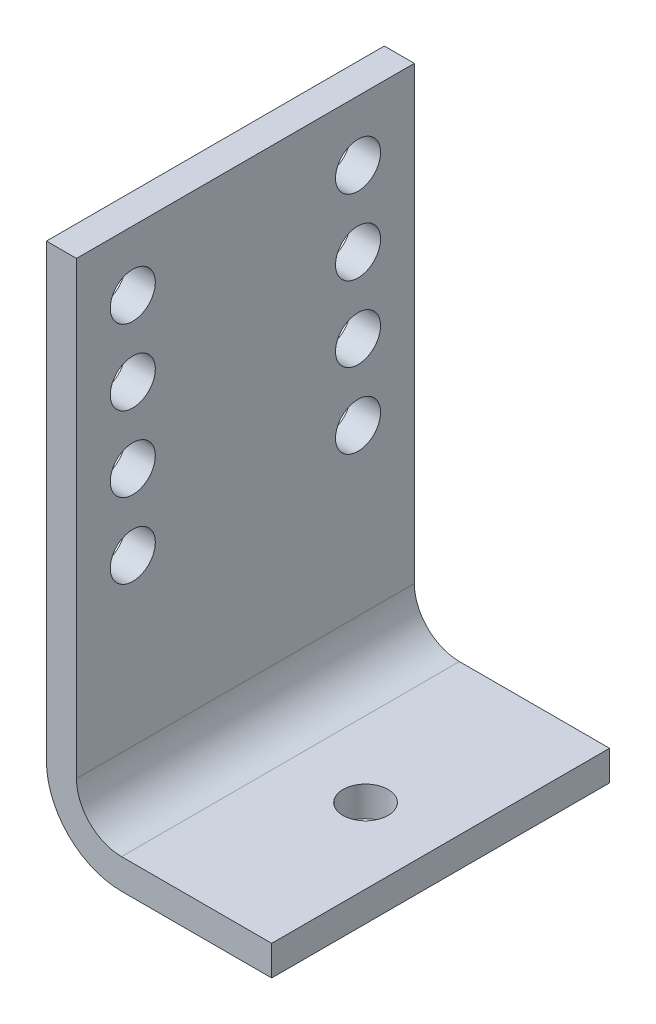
ISO-10303-21;
HEADER;
FILE_DESCRIPTION(('STEP AP214'),'2;1');
FILE_NAME('part.step','',(''),(''),'','','');
FILE_SCHEMA(('AUTOMOTIVE_DESIGN { 1 0 10303 214 1 1 1 1 }'));
ENDSEC;
DATA;
#1=APPLICATION_CONTEXT('core data for automotive mechanical design processes');
#2=APPLICATION_PROTOCOL_DEFINITION('international standard','automotive_design',2000,#1);
#3=PRODUCT_CONTEXT('',#1,'mechanical');
#4=PRODUCT('Part','Part','',(#3));
#5=PRODUCT_RELATED_PRODUCT_CATEGORY('part','',(#4));
#6=PRODUCT_DEFINITION_FORMATION('','',#4);
#7=PRODUCT_DEFINITION_CONTEXT('part definition',#1,'design');
#8=PRODUCT_DEFINITION('design','',#6,#7);
#9=PRODUCT_DEFINITION_SHAPE('','',#8);
#10=(LENGTH_UNIT() NAMED_UNIT(*) SI_UNIT(.MILLI.,.METRE.));
#11=(NAMED_UNIT(*) PLANE_ANGLE_UNIT() SI_UNIT($,.RADIAN.));
#12=(NAMED_UNIT(*) SI_UNIT($,.STERADIAN.) SOLID_ANGLE_UNIT());
#13=UNCERTAINTY_MEASURE_WITH_UNIT(LENGTH_MEASURE(1.E-05),#10,'distance_accuracy_value','');
#14=(GEOMETRIC_REPRESENTATION_CONTEXT(3) GLOBAL_UNCERTAINTY_ASSIGNED_CONTEXT((#13)) GLOBAL_UNIT_ASSIGNED_CONTEXT((#10,
#11,#12)) REPRESENTATION_CONTEXT('',''));
#15=CARTESIAN_POINT('',(0.,0.,0.));
#16=DIRECTION('',(0.,0.,1.));
#17=DIRECTION('',(1.,0.,0.));
#18=AXIS2_PLACEMENT_3D('',#15,#16,#17);
#19=CARTESIAN_POINT('',(4.,70.,22.5));
#20=DIRECTION('',(1.,0.,0.));
#21=DIRECTION('',(0.,1.,0.));
#22=AXIS2_PLACEMENT_3D('',#19,#20,#21);
#23=PLANE('',#22);
#24=CARTESIAN_POINT('',(3.99999999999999,32.,-15.));
#25=DIRECTION('',(1.,0.,0.));
#26=DIRECTION('',(0.,1.,0.));
#27=AXIS2_PLACEMENT_3D('',#24,#25,#26);
#28=CIRCLE('',#27,3.);
#29=CARTESIAN_POINT('',(3.99999999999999,35.,-15.));
#30=VERTEX_POINT('',#29);
#31=EDGE_CURVE('E252',#30,#30,#28,.T.);
#32=ORIENTED_EDGE('',*,*,#31,.F.);
#33=EDGE_LOOP('',(#32));
#34=FACE_BOUND('',#33,.T.);
#35=CARTESIAN_POINT('',(3.99999999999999,42.,15.));
#36=DIRECTION('',(-1.,0.,0.));
#37=DIRECTION('',(0.,-1.,0.));
#38=AXIS2_PLACEMENT_3D('',#35,#36,#37);
#39=CIRCLE('',#38,3.);
#40=CARTESIAN_POINT('',(3.99999999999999,39.,15.));
#41=VERTEX_POINT('',#40);
#42=EDGE_CURVE('E272',#41,#41,#39,.T.);
#43=ORIENTED_EDGE('',*,*,#42,.T.);
#44=EDGE_LOOP('',(#43));
#45=FACE_BOUND('',#44,.T.);
#46=CARTESIAN_POINT('',(3.99999999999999,52.,-15.));
#47=DIRECTION('',(1.,0.,0.));
#48=DIRECTION('',(0.,1.,0.));
#49=AXIS2_PLACEMENT_3D('',#46,#47,#48);
#50=CIRCLE('',#49,3.);
#51=CARTESIAN_POINT('',(4.,55.,-15.));
#52=VERTEX_POINT('',#51);
#53=EDGE_CURVE('E278',#52,#52,#50,.T.);
#54=ORIENTED_EDGE('',*,*,#53,.F.);
#55=EDGE_LOOP('',(#54));
#56=FACE_BOUND('',#55,.T.);
#57=CARTESIAN_POINT('',(4.,62.,15.));
#58=DIRECTION('',(-1.,0.,0.));
#59=DIRECTION('',(0.,-1.,0.));
#60=AXIS2_PLACEMENT_3D('',#57,#58,#59);
#61=CIRCLE('',#60,3.);
#62=CARTESIAN_POINT('',(4.,59.,15.));
#63=VERTEX_POINT('',#62);
#64=EDGE_CURVE('E113',#63,#63,#61,.T.);
#65=ORIENTED_EDGE('',*,*,#64,.T.);
#66=EDGE_LOOP('',(#65));
#67=FACE_BOUND('',#66,.T.);
#68=DIRECTION('',(0.,-1.,0.));
#69=VECTOR('',#68,1.);
#70=CARTESIAN_POINT('',(4.,70.,-22.5));
#71=LINE('',#70,#69);
#72=CARTESIAN_POINT('',(4.,70.,-22.5));
#73=VERTEX_POINT('',#72);
#74=CARTESIAN_POINT('',(3.99999999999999,9.99999999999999,-22.5));
#75=VERTEX_POINT('',#74);
#76=EDGE_CURVE('E123',#73,#75,#71,.T.);
#77=ORIENTED_EDGE('',*,*,#76,.F.);
#78=DIRECTION('',(0.,0.,-1.));
#79=VECTOR('',#78,1.);
#80=CARTESIAN_POINT('',(4.,70.,22.5));
#81=LINE('',#80,#79);
#82=CARTESIAN_POINT('',(4.,70.,22.5));
#83=VERTEX_POINT('',#82);
#84=EDGE_CURVE('E149',#83,#73,#81,.T.);
#85=ORIENTED_EDGE('',*,*,#84,.F.);
#86=DIRECTION('',(0.,-1.,0.));
#87=VECTOR('',#86,1.);
#88=CARTESIAN_POINT('',(4.,70.,22.5));
#89=LINE('',#88,#87);
#90=CARTESIAN_POINT('',(3.99999999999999,9.99999999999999,22.5));
#91=VERTEX_POINT('',#90);
#92=EDGE_CURVE('E140',#83,#91,#89,.T.);
#93=ORIENTED_EDGE('',*,*,#92,.T.);
#94=DIRECTION('',(0.,0.,-1.));
#95=VECTOR('',#94,1.);
#96=CARTESIAN_POINT('',(3.99999999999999,9.99999999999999,22.5));
#97=LINE('',#96,#95);
#98=EDGE_CURVE('E147',#91,#75,#97,.T.);
#99=ORIENTED_EDGE('',*,*,#98,.T.);
#100=EDGE_LOOP('',(#77,#85,#93,#99));
#101=FACE_BOUND('',#100,.T.);
#102=CARTESIAN_POINT('',(4.,62.,-15.));
#103=DIRECTION('',(1.,0.,0.));
#104=DIRECTION('',(0.,1.,0.));
#105=AXIS2_PLACEMENT_3D('',#102,#103,#104);
#106=CIRCLE('',#105,3.);
#107=CARTESIAN_POINT('',(4.,65.,-15.));
#108=VERTEX_POINT('',#107);
#109=EDGE_CURVE('E290',#108,#108,#106,.T.);
#110=ORIENTED_EDGE('',*,*,#109,.F.);
#111=EDGE_LOOP('',(#110));
#112=FACE_BOUND('',#111,.T.);
#113=CARTESIAN_POINT('',(3.99999999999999,52.,15.));
#114=DIRECTION('',(-1.,0.,0.));
#115=DIRECTION('',(0.,-1.,0.));
#116=AXIS2_PLACEMENT_3D('',#113,#114,#115);
#117=CIRCLE('',#116,3.);
#118=CARTESIAN_POINT('',(3.99999999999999,49.,15.));
#119=VERTEX_POINT('',#118);
#120=EDGE_CURVE('E284',#119,#119,#117,.T.);
#121=ORIENTED_EDGE('',*,*,#120,.T.);
#122=EDGE_LOOP('',(#121));
#123=FACE_BOUND('',#122,.T.);
#124=CARTESIAN_POINT('',(3.99999999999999,42.,-15.));
#125=DIRECTION('',(1.,0.,0.));
#126=DIRECTION('',(0.,1.,0.));
#127=AXIS2_PLACEMENT_3D('',#124,#125,#126);
#128=CIRCLE('',#127,3.);
#129=CARTESIAN_POINT('',(3.99999999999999,45.,-15.));
#130=VERTEX_POINT('',#129);
#131=EDGE_CURVE('E266',#130,#130,#128,.T.);
#132=ORIENTED_EDGE('',*,*,#131,.F.);
#133=EDGE_LOOP('',(#132));
#134=FACE_BOUND('',#133,.T.);
#135=CARTESIAN_POINT('',(3.99999999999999,32.,15.));
#136=DIRECTION('',(-1.,0.,0.));
#137=DIRECTION('',(0.,-1.,0.));
#138=AXIS2_PLACEMENT_3D('',#135,#136,#137);
#139=CIRCLE('',#138,3.);
#140=CARTESIAN_POINT('',(3.99999999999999,29.,15.));
#141=VERTEX_POINT('',#140);
#142=EDGE_CURVE('E260',#141,#141,#139,.T.);
#143=ORIENTED_EDGE('',*,*,#142,.T.);
#144=EDGE_LOOP('',(#143));
#145=FACE_BOUND('',#144,.T.);
#146=ADVANCED_FACE('F26',(#34,#45,#56,#67,#101,#112,#123,#134,#145),#23,.T.);
#147=CARTESIAN_POINT('',(0.,70.,22.5));
#148=DIRECTION('',(1.,0.,0.));
#149=DIRECTION('',(0.,1.,0.));
#150=AXIS2_PLACEMENT_3D('',#147,#148,#149);
#151=PLANE('',#150);
#152=CARTESIAN_POINT('',(0.,32.,-15.));
#153=DIRECTION('',(1.,0.,0.));
#154=DIRECTION('',(0.,1.,0.));
#155=AXIS2_PLACEMENT_3D('',#152,#153,#154);
#156=CIRCLE('',#155,3.);
#157=CARTESIAN_POINT('',(0.,35.,-15.));
#158=VERTEX_POINT('',#157);
#159=EDGE_CURVE('E257',#158,#158,#156,.T.);
#160=ORIENTED_EDGE('',*,*,#159,.T.);
#161=EDGE_LOOP('',(#160));
#162=FACE_BOUND('',#161,.T.);
#163=CARTESIAN_POINT('',(0.,42.,15.));
#164=DIRECTION('',(-1.,0.,0.));
#165=DIRECTION('',(0.,-1.,0.));
#166=AXIS2_PLACEMENT_3D('',#163,#164,#165);
#167=CIRCLE('',#166,3.);
#168=CARTESIAN_POINT('',(0.,39.,15.));
#169=VERTEX_POINT('',#168);
#170=EDGE_CURVE('E275',#169,#169,#167,.T.);
#171=ORIENTED_EDGE('',*,*,#170,.F.);
#172=EDGE_LOOP('',(#171));
#173=FACE_BOUND('',#172,.T.);
#174=CARTESIAN_POINT('',(0.,52.,-15.));
#175=DIRECTION('',(1.,0.,0.));
#176=DIRECTION('',(0.,1.,0.));
#177=AXIS2_PLACEMENT_3D('',#174,#175,#176);
#178=CIRCLE('',#177,3.);
#179=CARTESIAN_POINT('',(0.,55.,-15.));
#180=VERTEX_POINT('',#179);
#181=EDGE_CURVE('E281',#180,#180,#178,.T.);
#182=ORIENTED_EDGE('',*,*,#181,.T.);
#183=EDGE_LOOP('',(#182));
#184=FACE_BOUND('',#183,.T.);
#185=CARTESIAN_POINT('',(0.,62.,15.));
#186=DIRECTION('',(-1.,0.,0.));
#187=DIRECTION('',(0.,-1.,0.));
#188=AXIS2_PLACEMENT_3D('',#185,#186,#187);
#189=CIRCLE('',#188,3.);
#190=CARTESIAN_POINT('',(0.,59.,15.));
#191=VERTEX_POINT('',#190);
#192=EDGE_CURVE('E110',#191,#191,#189,.T.);
#193=ORIENTED_EDGE('',*,*,#192,.F.);
#194=EDGE_LOOP('',(#193));
#195=FACE_BOUND('',#194,.T.);
#196=DIRECTION('',(0.,-1.,0.));
#197=VECTOR('',#196,1.);
#198=CARTESIAN_POINT('',(0.,70.,-22.5));
#199=LINE('',#198,#197);
#200=CARTESIAN_POINT('',(0.,70.,-22.5));
#201=VERTEX_POINT('',#200);
#202=CARTESIAN_POINT('',(0.,10.,-22.5));
#203=VERTEX_POINT('',#202);
#204=EDGE_CURVE('E118',#201,#203,#199,.T.);
#205=ORIENTED_EDGE('',*,*,#204,.T.);
#206=DIRECTION('',(0.,0.,-1.));
#207=VECTOR('',#206,1.);
#208=CARTESIAN_POINT('',(0.,10.,22.5));
#209=LINE('',#208,#207);
#210=CARTESIAN_POINT('',(0.,10.,22.5));
#211=VERTEX_POINT('',#210);
#212=EDGE_CURVE('E154',#211,#203,#209,.T.);
#213=ORIENTED_EDGE('',*,*,#212,.F.);
#214=DIRECTION('',(0.,-1.,0.));
#215=VECTOR('',#214,1.);
#216=CARTESIAN_POINT('',(0.,70.,22.5));
#217=LINE('',#216,#215);
#218=CARTESIAN_POINT('',(0.,70.,22.5));
#219=VERTEX_POINT('',#218);
#220=EDGE_CURVE('E136',#219,#211,#217,.T.);
#221=ORIENTED_EDGE('',*,*,#220,.F.);
#222=DIRECTION('',(0.,0.,-1.));
#223=VECTOR('',#222,1.);
#224=CARTESIAN_POINT('',(0.,70.,22.5));
#225=LINE('',#224,#223);
#226=EDGE_CURVE('E151',#219,#201,#225,.T.);
#227=ORIENTED_EDGE('',*,*,#226,.T.);
#228=EDGE_LOOP('',(#205,#213,#221,#227));
#229=FACE_BOUND('',#228,.T.);
#230=CARTESIAN_POINT('',(0.,62.,-15.));
#231=DIRECTION('',(1.,0.,0.));
#232=DIRECTION('',(0.,1.,0.));
#233=AXIS2_PLACEMENT_3D('',#230,#231,#232);
#234=CIRCLE('',#233,3.);
#235=CARTESIAN_POINT('',(0.,65.,-15.));
#236=VERTEX_POINT('',#235);
#237=EDGE_CURVE('E293',#236,#236,#234,.T.);
#238=ORIENTED_EDGE('',*,*,#237,.T.);
#239=EDGE_LOOP('',(#238));
#240=FACE_BOUND('',#239,.T.);
#241=CARTESIAN_POINT('',(0.,52.,15.));
#242=DIRECTION('',(-1.,0.,0.));
#243=DIRECTION('',(0.,-1.,0.));
#244=AXIS2_PLACEMENT_3D('',#241,#242,#243);
#245=CIRCLE('',#244,3.);
#246=CARTESIAN_POINT('',(0.,49.,15.));
#247=VERTEX_POINT('',#246);
#248=EDGE_CURVE('E287',#247,#247,#245,.T.);
#249=ORIENTED_EDGE('',*,*,#248,.F.);
#250=EDGE_LOOP('',(#249));
#251=FACE_BOUND('',#250,.T.);
#252=CARTESIAN_POINT('',(0.,42.,-15.));
#253=DIRECTION('',(1.,0.,0.));
#254=DIRECTION('',(0.,1.,0.));
#255=AXIS2_PLACEMENT_3D('',#252,#253,#254);
#256=CIRCLE('',#255,3.);
#257=CARTESIAN_POINT('',(0.,45.,-15.));
#258=VERTEX_POINT('',#257);
#259=EDGE_CURVE('E269',#258,#258,#256,.T.);
#260=ORIENTED_EDGE('',*,*,#259,.T.);
#261=EDGE_LOOP('',(#260));
#262=FACE_BOUND('',#261,.T.);
#263=CARTESIAN_POINT('',(0.,32.,15.));
#264=DIRECTION('',(-1.,0.,0.));
#265=DIRECTION('',(0.,-1.,0.));
#266=AXIS2_PLACEMENT_3D('',#263,#264,#265);
#267=CIRCLE('',#266,3.);
#268=CARTESIAN_POINT('',(0.,29.,15.));
#269=VERTEX_POINT('',#268);
#270=EDGE_CURVE('E263',#269,#269,#267,.T.);
#271=ORIENTED_EDGE('',*,*,#270,.F.);
#272=EDGE_LOOP('',(#271));
#273=FACE_BOUND('',#272,.T.);
#274=ADVANCED_FACE('F162',(#162,#173,#184,#195,#229,#240,#251,#262,#273),#151,.F.);
#275=CARTESIAN_POINT('',(30.,4.,22.5));
#276=DIRECTION('',(1.,0.,0.));
#277=DIRECTION('',(0.,0.,-1.));
#278=AXIS2_PLACEMENT_3D('',#275,#276,#277);
#279=PLANE('',#278);
#280=DIRECTION('',(0.,-1.,0.));
#281=VECTOR('',#280,1.);
#282=CARTESIAN_POINT('',(30.,4.,-22.5));
#283=LINE('',#282,#281);
#284=CARTESIAN_POINT('',(30.,4.,-22.5));
#285=VERTEX_POINT('',#284);
#286=CARTESIAN_POINT('',(30.,0.,-22.5));
#287=VERTEX_POINT('',#286);
#288=EDGE_CURVE('E92',#285,#287,#283,.T.);
#289=ORIENTED_EDGE('',*,*,#288,.F.);
#290=DIRECTION('',(0.,0.,-1.));
#291=VECTOR('',#290,1.);
#292=CARTESIAN_POINT('',(30.,4.,22.5));
#293=LINE('',#292,#291);
#294=CARTESIAN_POINT('',(30.,4.,22.5));
#295=VERTEX_POINT('',#294);
#296=EDGE_CURVE('E11',#295,#285,#293,.T.);
#297=ORIENTED_EDGE('',*,*,#296,.F.);
#298=DIRECTION('',(0.,-1.,0.));
#299=VECTOR('',#298,1.);
#300=CARTESIAN_POINT('',(30.,4.,22.5));
#301=LINE('',#300,#299);
#302=CARTESIAN_POINT('',(30.,0.,22.5));
#303=VERTEX_POINT('',#302);
#304=EDGE_CURVE('E94',#295,#303,#301,.T.);
#305=ORIENTED_EDGE('',*,*,#304,.T.);
#306=DIRECTION('',(0.,0.,-1.));
#307=VECTOR('',#306,1.);
#308=CARTESIAN_POINT('',(30.,0.,22.5));
#309=LINE('',#308,#307);
#310=EDGE_CURVE('E30',#303,#287,#309,.T.);
#311=ORIENTED_EDGE('',*,*,#310,.T.);
#312=EDGE_LOOP('',(#289,#297,#305,#311));
#313=FACE_BOUND('',#312,.T.);
#314=ADVANCED_FACE('F28',(#313),#279,.T.);
#315=CARTESIAN_POINT('',(9.99999999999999,4.,22.5));
#316=DIRECTION('',(0.,1.,0.));
#317=DIRECTION('',(0.,0.,1.));
#318=AXIS2_PLACEMENT_3D('',#315,#316,#317);
#319=PLANE('',#318);
#320=CARTESIAN_POINT('',(20.,4.,0.));
#321=DIRECTION('',(0.,1.,0.));
#322=DIRECTION('',(0.,0.,1.));
#323=AXIS2_PLACEMENT_3D('',#320,#321,#322);
#324=CIRCLE('',#323,3.);
#325=CARTESIAN_POINT('',(20.,4.,3.));
#326=VERTEX_POINT('',#325);
#327=EDGE_CURVE('E250',#326,#326,#324,.T.);
#328=ORIENTED_EDGE('',*,*,#327,.F.);
#329=EDGE_LOOP('',(#328));
#330=FACE_BOUND('',#329,.T.);
#331=DIRECTION('',(1.,0.,0.));
#332=VECTOR('',#331,1.);
#333=CARTESIAN_POINT('',(9.99999999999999,4.,-22.5));
#334=LINE('',#333,#332);
#335=CARTESIAN_POINT('',(9.99999999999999,4.,-22.5));
#336=VERTEX_POINT('',#335);
#337=EDGE_CURVE('E109',#336,#285,#334,.T.);
#338=ORIENTED_EDGE('',*,*,#337,.F.);
#339=DIRECTION('',(0.,0.,-1.));
#340=VECTOR('',#339,1.);
#341=CARTESIAN_POINT('',(9.99999999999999,4.,22.5));
#342=LINE('',#341,#340);
#343=CARTESIAN_POINT('',(9.99999999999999,4.,22.5));
#344=VERTEX_POINT('',#343);
#345=EDGE_CURVE('E35',#344,#336,#342,.T.);
#346=ORIENTED_EDGE('',*,*,#345,.F.);
#347=DIRECTION('',(1.,0.,0.));
#348=VECTOR('',#347,1.);
#349=CARTESIAN_POINT('',(9.99999999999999,4.,22.5));
#350=LINE('',#349,#348);
#351=EDGE_CURVE('E98',#344,#295,#350,.T.);
#352=ORIENTED_EDGE('',*,*,#351,.T.);
#353=ORIENTED_EDGE('',*,*,#296,.T.);
#354=EDGE_LOOP('',(#338,#346,#352,#353));
#355=FACE_BOUND('',#354,.T.);
#356=ADVANCED_FACE('F175',(#330,#355),#319,.T.);
#357=CARTESIAN_POINT('',(9.99999999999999,9.99999999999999,22.5));
#358=DIRECTION('',(0.,0.,-1.));
#359=DIRECTION('',(-1.,0.,0.));
#360=AXIS2_PLACEMENT_3D('',#357,#358,#359);
#361=CYLINDRICAL_SURFACE('',#360,6.);
#362=CARTESIAN_POINT('',(9.99999999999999,9.99999999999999,-22.5));
#363=DIRECTION('',(0.,0.,1.));
#364=DIRECTION('',(1.,0.,0.));
#365=AXIS2_PLACEMENT_3D('',#362,#363,#364);
#366=CIRCLE('',#365,6.);
#367=EDGE_CURVE('E126',#336,#75,#366,.F.);
#368=ORIENTED_EDGE('',*,*,#367,.T.);
#369=ORIENTED_EDGE('',*,*,#98,.F.);
#370=CARTESIAN_POINT('',(9.99999999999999,9.99999999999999,22.5));
#371=DIRECTION('',(0.,0.,1.));
#372=DIRECTION('',(1.,0.,0.));
#373=AXIS2_PLACEMENT_3D('',#370,#371,#372);
#374=CIRCLE('',#373,6.);
#375=EDGE_CURVE('E143',#344,#91,#374,.F.);
#376=ORIENTED_EDGE('',*,*,#375,.F.);
#377=ORIENTED_EDGE('',*,*,#345,.T.);
#378=EDGE_LOOP('',(#368,#369,#376,#377));
#379=FACE_BOUND('',#378,.T.);
#380=ADVANCED_FACE('F174',(#379),#361,.F.);
#381=CARTESIAN_POINT('',(4.,70.,22.5));
#382=DIRECTION('',(0.,-1.,0.));
#383=DIRECTION('',(0.,0.,-1.));
#384=AXIS2_PLACEMENT_3D('',#381,#382,#383);
#385=PLANE('',#384);
#386=DIRECTION('',(-1.,0.,0.));
#387=VECTOR('',#386,1.);
#388=CARTESIAN_POINT('',(4.,70.,-22.5));
#389=LINE('',#388,#387);
#390=EDGE_CURVE('E121',#73,#201,#389,.T.);
#391=ORIENTED_EDGE('',*,*,#390,.T.);
#392=ORIENTED_EDGE('',*,*,#226,.F.);
#393=DIRECTION('',(-1.,0.,0.));
#394=VECTOR('',#393,1.);
#395=CARTESIAN_POINT('',(4.,70.,22.5));
#396=LINE('',#395,#394);
#397=EDGE_CURVE('E138',#83,#219,#396,.T.);
#398=ORIENTED_EDGE('',*,*,#397,.F.);
#399=ORIENTED_EDGE('',*,*,#84,.T.);
#400=EDGE_LOOP('',(#391,#392,#398,#399));
#401=FACE_BOUND('',#400,.T.);
#402=ADVANCED_FACE('F179',(#401),#385,.F.);
#403=CARTESIAN_POINT('',(9.99999999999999,9.99999999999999,22.5));
#404=DIRECTION('',(0.,0.,-1.));
#405=DIRECTION('',(-1.,0.,0.));
#406=AXIS2_PLACEMENT_3D('',#403,#404,#405);
#407=CYLINDRICAL_SURFACE('',#406,10.);
#408=CARTESIAN_POINT('',(9.99999999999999,9.99999999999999,-22.5));
#409=DIRECTION('',(0.,0.,-1.));
#410=DIRECTION('',(-1.,0.,0.));
#411=AXIS2_PLACEMENT_3D('',#408,#409,#410);
#412=CIRCLE('',#411,10.);
#413=CARTESIAN_POINT('',(9.99999999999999,0.,-22.5));
#414=VERTEX_POINT('',#413);
#415=EDGE_CURVE('E105',#414,#203,#412,.T.);
#416=ORIENTED_EDGE('',*,*,#415,.F.);
#417=DIRECTION('',(0.,0.,-1.));
#418=VECTOR('',#417,1.);
#419=CARTESIAN_POINT('',(9.99999999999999,0.,22.5));
#420=LINE('',#419,#418);
#421=CARTESIAN_POINT('',(9.99999999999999,0.,22.5));
#422=VERTEX_POINT('',#421);
#423=EDGE_CURVE('E97',#422,#414,#420,.T.);
#424=ORIENTED_EDGE('',*,*,#423,.F.);
#425=CARTESIAN_POINT('',(9.99999999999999,9.99999999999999,22.5));
#426=DIRECTION('',(0.,0.,-1.));
#427=DIRECTION('',(-1.,0.,0.));
#428=AXIS2_PLACEMENT_3D('',#425,#426,#427);
#429=CIRCLE('',#428,10.);
#430=EDGE_CURVE('E133',#422,#211,#429,.T.);
#431=ORIENTED_EDGE('',*,*,#430,.T.);
#432=ORIENTED_EDGE('',*,*,#212,.T.);
#433=EDGE_LOOP('',(#416,#424,#431,#432));
#434=FACE_BOUND('',#433,.T.);
#435=ADVANCED_FACE('F157',(#434),#407,.T.);
#436=CARTESIAN_POINT('',(9.99999999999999,0.,22.5));
#437=DIRECTION('',(0.,1.,0.));
#438=DIRECTION('',(0.,0.,1.));
#439=AXIS2_PLACEMENT_3D('',#436,#437,#438);
#440=PLANE('',#439);
#441=CARTESIAN_POINT('',(20.,0.,0.));
#442=DIRECTION('',(0.,1.,0.));
#443=DIRECTION('',(0.,0.,1.));
#444=AXIS2_PLACEMENT_3D('',#441,#442,#443);
#445=CIRCLE('',#444,3.);
#446=CARTESIAN_POINT('',(20.,0.,3.));
#447=VERTEX_POINT('',#446);
#448=EDGE_CURVE('E247',#447,#447,#445,.T.);
#449=ORIENTED_EDGE('',*,*,#448,.T.);
#450=EDGE_LOOP('',(#449));
#451=FACE_BOUND('',#450,.T.);
#452=DIRECTION('',(1.,0.,0.));
#453=VECTOR('',#452,1.);
#454=CARTESIAN_POINT('',(9.99999999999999,0.,-22.5));
#455=LINE('',#454,#453);
#456=EDGE_CURVE('E100',#414,#287,#455,.T.);
#457=ORIENTED_EDGE('',*,*,#456,.T.);
#458=ORIENTED_EDGE('',*,*,#310,.F.);
#459=DIRECTION('',(1.,0.,0.));
#460=VECTOR('',#459,1.);
#461=CARTESIAN_POINT('',(9.99999999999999,0.,22.5));
#462=LINE('',#461,#460);
#463=EDGE_CURVE('E131',#422,#303,#462,.T.);
#464=ORIENTED_EDGE('',*,*,#463,.F.);
#465=ORIENTED_EDGE('',*,*,#423,.T.);
#466=EDGE_LOOP('',(#457,#458,#464,#465));
#467=FACE_BOUND('',#466,.T.);
#468=ADVANCED_FACE('F101',(#451,#467),#440,.F.);
#469=CARTESIAN_POINT('',(9.99999999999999,9.99999999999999,22.5));
#470=DIRECTION('',(0.,0.,-1.));
#471=DIRECTION('',(-1.,0.,0.));
#472=AXIS2_PLACEMENT_3D('',#469,#470,#471);
#473=PLANE('',#472);
#474=ORIENTED_EDGE('',*,*,#304,.F.);
#475=ORIENTED_EDGE('',*,*,#351,.F.);
#476=ORIENTED_EDGE('',*,*,#375,.T.);
#477=ORIENTED_EDGE('',*,*,#92,.F.);
#478=ORIENTED_EDGE('',*,*,#397,.T.);
#479=ORIENTED_EDGE('',*,*,#220,.T.);
#480=ORIENTED_EDGE('',*,*,#430,.F.);
#481=ORIENTED_EDGE('',*,*,#463,.T.);
#482=EDGE_LOOP('',(#474,#475,#476,#477,#478,#479,#480,#481));
#483=FACE_BOUND('',#482,.T.);
#484=ADVANCED_FACE('F178',(#483),#473,.F.);
#485=CARTESIAN_POINT('',(9.99999999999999,9.99999999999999,-22.5));
#486=DIRECTION('',(0.,0.,-1.));
#487=DIRECTION('',(-1.,0.,0.));
#488=AXIS2_PLACEMENT_3D('',#485,#486,#487);
#489=PLANE('',#488);
#490=ORIENTED_EDGE('',*,*,#288,.T.);
#491=ORIENTED_EDGE('',*,*,#456,.F.);
#492=ORIENTED_EDGE('',*,*,#415,.T.);
#493=ORIENTED_EDGE('',*,*,#204,.F.);
#494=ORIENTED_EDGE('',*,*,#390,.F.);
#495=ORIENTED_EDGE('',*,*,#76,.T.);
#496=ORIENTED_EDGE('',*,*,#367,.F.);
#497=ORIENTED_EDGE('',*,*,#337,.T.);
#498=EDGE_LOOP('',(#490,#491,#492,#493,#494,#495,#496,#497));
#499=FACE_BOUND('',#498,.T.);
#500=ADVANCED_FACE('F107',(#499),#489,.T.);
#501=CARTESIAN_POINT('',(0.,62.,15.));
#502=DIRECTION('',(1.,0.,0.));
#503=DIRECTION('',(0.,1.,0.));
#504=AXIS2_PLACEMENT_3D('',#501,#502,#503);
#505=CYLINDRICAL_SURFACE('',#504,3.);
#506=ORIENTED_EDGE('',*,*,#192,.T.);
#507=EDGE_LOOP('',(#506));
#508=FACE_BOUND('',#507,.T.);
#509=ORIENTED_EDGE('',*,*,#64,.F.);
#510=EDGE_LOOP('',(#509));
#511=FACE_BOUND('',#510,.T.);
#512=ADVANCED_FACE('F207',(#508,#511),#505,.F.);
#513=CARTESIAN_POINT('',(0.,62.,-15.));
#514=DIRECTION('',(1.,0.,0.));
#515=DIRECTION('',(0.,1.,0.));
#516=AXIS2_PLACEMENT_3D('',#513,#514,#515);
#517=CYLINDRICAL_SURFACE('',#516,3.);
#518=ORIENTED_EDGE('',*,*,#237,.F.);
#519=EDGE_LOOP('',(#518));
#520=FACE_BOUND('',#519,.T.);
#521=ORIENTED_EDGE('',*,*,#109,.T.);
#522=EDGE_LOOP('',(#521));
#523=FACE_BOUND('',#522,.T.);
#524=ADVANCED_FACE('F210',(#520,#523),#517,.F.);
#525=CARTESIAN_POINT('',(0.,52.,15.));
#526=DIRECTION('',(1.,0.,0.));
#527=DIRECTION('',(0.,1.,0.));
#528=AXIS2_PLACEMENT_3D('',#525,#526,#527);
#529=CYLINDRICAL_SURFACE('',#528,3.);
#530=ORIENTED_EDGE('',*,*,#248,.T.);
#531=EDGE_LOOP('',(#530));
#532=FACE_BOUND('',#531,.T.);
#533=ORIENTED_EDGE('',*,*,#120,.F.);
#534=EDGE_LOOP('',(#533));
#535=FACE_BOUND('',#534,.T.);
#536=ADVANCED_FACE('F213',(#532,#535),#529,.F.);
#537=CARTESIAN_POINT('',(0.,52.,-15.));
#538=DIRECTION('',(1.,0.,0.));
#539=DIRECTION('',(0.,1.,0.));
#540=AXIS2_PLACEMENT_3D('',#537,#538,#539);
#541=CYLINDRICAL_SURFACE('',#540,3.);
#542=ORIENTED_EDGE('',*,*,#181,.F.);
#543=EDGE_LOOP('',(#542));
#544=FACE_BOUND('',#543,.T.);
#545=ORIENTED_EDGE('',*,*,#53,.T.);
#546=EDGE_LOOP('',(#545));
#547=FACE_BOUND('',#546,.T.);
#548=ADVANCED_FACE('F217',(#544,#547),#541,.F.);
#549=CARTESIAN_POINT('',(0.,42.,15.));
#550=DIRECTION('',(1.,0.,0.));
#551=DIRECTION('',(0.,1.,0.));
#552=AXIS2_PLACEMENT_3D('',#549,#550,#551);
#553=CYLINDRICAL_SURFACE('',#552,3.);
#554=ORIENTED_EDGE('',*,*,#170,.T.);
#555=EDGE_LOOP('',(#554));
#556=FACE_BOUND('',#555,.T.);
#557=ORIENTED_EDGE('',*,*,#42,.F.);
#558=EDGE_LOOP('',(#557));
#559=FACE_BOUND('',#558,.T.);
#560=ADVANCED_FACE('F221',(#556,#559),#553,.F.);
#561=CARTESIAN_POINT('',(0.,42.,-15.));
#562=DIRECTION('',(1.,0.,0.));
#563=DIRECTION('',(0.,1.,0.));
#564=AXIS2_PLACEMENT_3D('',#561,#562,#563);
#565=CYLINDRICAL_SURFACE('',#564,3.);
#566=ORIENTED_EDGE('',*,*,#259,.F.);
#567=EDGE_LOOP('',(#566));
#568=FACE_BOUND('',#567,.T.);
#569=ORIENTED_EDGE('',*,*,#131,.T.);
#570=EDGE_LOOP('',(#569));
#571=FACE_BOUND('',#570,.T.);
#572=ADVANCED_FACE('F225',(#568,#571),#565,.F.);
#573=CARTESIAN_POINT('',(0.,32.,15.));
#574=DIRECTION('',(1.,0.,0.));
#575=DIRECTION('',(0.,1.,0.));
#576=AXIS2_PLACEMENT_3D('',#573,#574,#575);
#577=CYLINDRICAL_SURFACE('',#576,3.);
#578=ORIENTED_EDGE('',*,*,#270,.T.);
#579=EDGE_LOOP('',(#578));
#580=FACE_BOUND('',#579,.T.);
#581=ORIENTED_EDGE('',*,*,#142,.F.);
#582=EDGE_LOOP('',(#581));
#583=FACE_BOUND('',#582,.T.);
#584=ADVANCED_FACE('F229',(#580,#583),#577,.F.);
#585=CARTESIAN_POINT('',(0.,32.,-15.));
#586=DIRECTION('',(1.,0.,0.));
#587=DIRECTION('',(0.,1.,0.));
#588=AXIS2_PLACEMENT_3D('',#585,#586,#587);
#589=CYLINDRICAL_SURFACE('',#588,3.);
#590=ORIENTED_EDGE('',*,*,#159,.F.);
#591=EDGE_LOOP('',(#590));
#592=FACE_BOUND('',#591,.T.);
#593=ORIENTED_EDGE('',*,*,#31,.T.);
#594=EDGE_LOOP('',(#593));
#595=FACE_BOUND('',#594,.T.);
#596=ADVANCED_FACE('F233',(#592,#595),#589,.F.);
#597=CARTESIAN_POINT('',(20.,0.,0.));
#598=DIRECTION('',(0.,1.,0.));
#599=DIRECTION('',(0.,0.,1.));
#600=AXIS2_PLACEMENT_3D('',#597,#598,#599);
#601=CYLINDRICAL_SURFACE('',#600,3.);
#602=ORIENTED_EDGE('',*,*,#448,.F.);
#603=EDGE_LOOP('',(#602));
#604=FACE_BOUND('',#603,.T.);
#605=ORIENTED_EDGE('',*,*,#327,.T.);
#606=EDGE_LOOP('',(#605));
#607=FACE_BOUND('',#606,.T.);
#608=ADVANCED_FACE('F237',(#604,#607),#601,.F.);
#609=CLOSED_SHELL('',(#146,#274,#314,#356,#380,#402,#435,#468,#484,#500,#512,#524,#536,#548,
#560,#572,#584,#596,#608));
#610=MANIFOLD_SOLID_BREP('B2',#609);
#611=ADVANCED_BREP_SHAPE_REPRESENTATION('',(#18,#610),#14);
#612=SHAPE_DEFINITION_REPRESENTATION(#9,#611);
ENDSEC;
END-ISO-10303-21;
